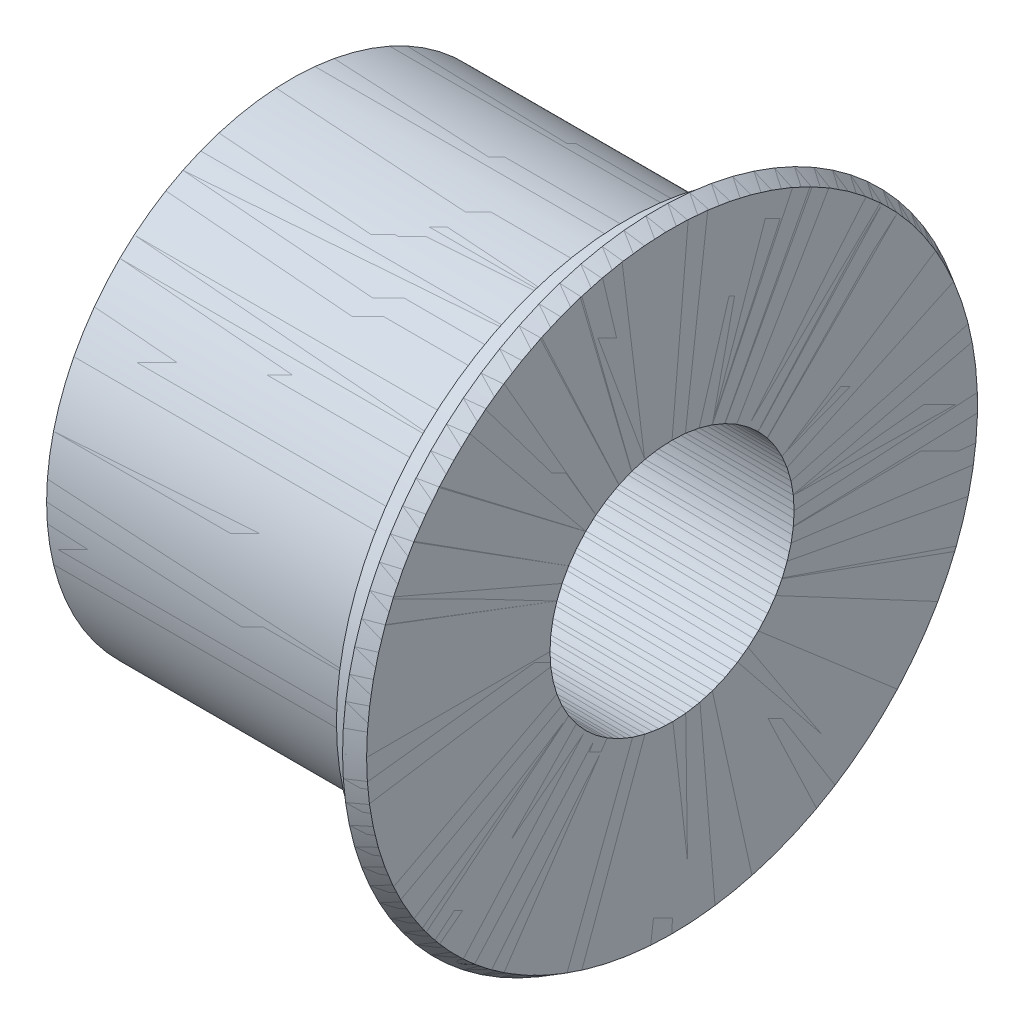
ISO-10303-21;
HEADER;
FILE_DESCRIPTION(('STEP AP214'),'2;1');
FILE_NAME('part.step','',(''),(''),'','','');
FILE_SCHEMA(('AUTOMOTIVE_DESIGN { 1 0 10303 214 1 1 1 1 }'));
ENDSEC;
DATA;
#1=APPLICATION_CONTEXT('core data for automotive mechanical design processes');
#2=APPLICATION_PROTOCOL_DEFINITION('international standard','automotive_design',2000,#1);
#3=PRODUCT_CONTEXT('',#1,'mechanical');
#4=PRODUCT('Part','Part','',(#3));
#5=PRODUCT_RELATED_PRODUCT_CATEGORY('part','',(#4));
#6=PRODUCT_DEFINITION_FORMATION('','',#4);
#7=PRODUCT_DEFINITION_CONTEXT('part definition',#1,'design');
#8=PRODUCT_DEFINITION('design','',#6,#7);
#9=PRODUCT_DEFINITION_SHAPE('','',#8);
#10=(LENGTH_UNIT() NAMED_UNIT(*) SI_UNIT(.MILLI.,.METRE.));
#11=(NAMED_UNIT(*) PLANE_ANGLE_UNIT() SI_UNIT($,.RADIAN.));
#12=(NAMED_UNIT(*) SI_UNIT($,.STERADIAN.) SOLID_ANGLE_UNIT());
#13=UNCERTAINTY_MEASURE_WITH_UNIT(LENGTH_MEASURE(1.E-05),#10,'distance_accuracy_value','');
#14=(GEOMETRIC_REPRESENTATION_CONTEXT(3) GLOBAL_UNCERTAINTY_ASSIGNED_CONTEXT((#13)) GLOBAL_UNIT_ASSIGNED_CONTEXT((#10,
#11,#12)) REPRESENTATION_CONTEXT('',''));
#15=CARTESIAN_POINT('',(0.,0.,0.));
#16=DIRECTION('',(0.,0.,1.));
#17=DIRECTION('',(1.,0.,0.));
#18=AXIS2_PLACEMENT_3D('',#15,#16,#17);
#19=CARTESIAN_POINT('',(25.,0.,0.));
#20=DIRECTION('',(-1.,0.,0.));
#21=DIRECTION('',(0.,0.,1.));
#22=AXIS2_PLACEMENT_3D('',#19,#20,#21);
#23=CONICAL_SURFACE('',#22,20.0226497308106,0.52359877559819);
#24=CARTESIAN_POINT('',(24.,0.,0.));
#25=DIRECTION('',(-1.,0.,0.));
#26=DIRECTION('',(0.,0.,1.));
#27=AXIS2_PLACEMENT_3D('',#24,#25,#26);
#28=CIRCLE('',#27,20.6000000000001);
#29=CARTESIAN_POINT('',(24.,0.,20.6000000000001));
#30=VERTEX_POINT('',#29);
#31=EDGE_CURVE('P0_E93',#30,#30,#28,.T.);
#32=ORIENTED_EDGE('',*,*,#31,.F.);
#33=EDGE_LOOP('',(#32));
#34=FACE_BOUND('',#33,.T.);
#35=CARTESIAN_POINT('',(25.0502,-14.5941538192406,13.6659205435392));
#36=CARTESIAN_POINT('',(25.0134050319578,-14.6074747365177,13.6827670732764));
#37=CARTESIAN_POINT('',(24.9763212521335,-14.6237358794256,13.696731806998));
#38=CARTESIAN_POINT('',(24.9028215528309,-14.6615461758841,13.7184393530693));
#39=CARTESIAN_POINT('',(24.8664092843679,-14.6831182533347,13.7261545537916));
#40=CARTESIAN_POINT('',(24.800336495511,-14.727793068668,13.7342007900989));
#41=CARTESIAN_POINT('',(24.7704064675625,-14.750351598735,13.735346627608));
#42=CARTESIAN_POINT('',(24.7133785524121,-14.7983592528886,13.7320608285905));
#43=CARTESIAN_POINT('',(24.686272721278,-14.8237998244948,13.7276453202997));
#44=CARTESIAN_POINT('',(24.6417129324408,-14.8708810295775,13.7145970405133));
#45=CARTESIAN_POINT('',(24.623458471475,-14.8920919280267,13.7071340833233));
#46=CARTESIAN_POINT('',(24.5899994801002,-14.9353518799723,13.6885915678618));
#47=CARTESIAN_POINT('',(24.5747944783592,-14.9574008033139,13.6775125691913));
#48=CARTESIAN_POINT('',(24.5480502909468,-15.0018440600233,13.6517038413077));
#49=CARTESIAN_POINT('',(24.5365343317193,-15.0242396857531,13.6369519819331));
#50=CARTESIAN_POINT('',(24.517969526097,-15.0684290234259,13.6041078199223));
#51=CARTESIAN_POINT('',(24.5109171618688,-15.0902231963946,13.5860181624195));
#52=CARTESIAN_POINT('',(24.502273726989,-15.129881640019,13.5493141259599));
#53=CARTESIAN_POINT('',(24.5001464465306,-15.1479092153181,13.5310010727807));
#54=CARTESIAN_POINT('',(24.4998683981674,-15.1821929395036,13.4927639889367));
#55=CARTESIAN_POINT('',(24.5017161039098,-15.1984497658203,13.472840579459));
#56=CARTESIAN_POINT('',(24.5090547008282,-15.2278073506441,13.4332435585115));
#57=CARTESIAN_POINT('',(24.5143253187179,-15.2410373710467,13.4136239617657));
#58=CARTESIAN_POINT('',(24.528036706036,-15.2652132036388,13.3740946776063));
#59=CARTESIAN_POINT('',(24.5364777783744,-15.2761587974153,13.3541849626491));
#60=CARTESIAN_POINT('',(24.5565877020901,-15.296023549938,13.3137509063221));
#61=CARTESIAN_POINT('',(24.5683768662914,-15.3048387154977,13.2932357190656));
#62=CARTESIAN_POINT('',(24.5945571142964,-15.3197916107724,13.2529089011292));
#63=CARTESIAN_POINT('',(24.6089491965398,-15.3259283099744,13.233097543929));
#64=CARTESIAN_POINT('',(24.6416414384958,-15.3361231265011,13.1923590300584));
#65=CARTESIAN_POINT('',(24.6601998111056,-15.3398660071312,13.171560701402));
#66=CARTESIAN_POINT('',(24.699402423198,-15.3442412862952,13.1316800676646));
#67=CARTESIAN_POINT('',(24.7200476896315,-15.3448721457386,13.1125986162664));
#68=CARTESIAN_POINT('',(24.7659280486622,-15.3430819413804,13.0738904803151));
#69=CARTESIAN_POINT('',(24.791400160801,-15.340218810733,13.0545650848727));
#70=CARTESIAN_POINT('',(24.8437202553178,-15.33094161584,13.0188401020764));
#71=CARTESIAN_POINT('',(24.8705690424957,-15.3245254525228,13.0024422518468));
#72=CARTESIAN_POINT('',(24.9228758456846,-15.3090347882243,12.9740161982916));
#73=CARTESIAN_POINT('',(24.9482768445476,-15.3002094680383,12.9617455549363));
#74=CARTESIAN_POINT('',(24.9992265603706,-15.2799665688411,12.9401312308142));
#75=CARTESIAN_POINT('',(25.0247749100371,-15.2685538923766,12.9307820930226));
#76=CARTESIAN_POINT('',(25.0502,-15.2559318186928,12.9229738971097));
#77=B_SPLINE_CURVE_WITH_KNOTS('',3,(#35,#36,#37,#38,#39,#40,#41,#42,#43,#44,#45,#46,#47,#48,#49,
#50,#51,#52,#53,#54,#55,#56,#57,#58,#59,#60,#61,#62,#63,#64,#65,#66,#67,#68,#69,#70,#71,#72,#73,
#74,#75,#76),.UNSPECIFIED.,.F.,.F.,(4,2,2,2,2,2,2,2,2,2,2,2,2,2,2,2,2,2,2,2,4),(0.,
0.127678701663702,0.255918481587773,0.367837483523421,0.479432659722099,0.565965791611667,
0.652485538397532,0.739539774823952,0.826525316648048,0.903475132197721,0.980395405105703,
1.05279942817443,1.12521037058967,1.20065211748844,1.27612286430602,1.36016526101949,
1.44424921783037,1.54016827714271,1.63614406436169,1.72456054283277,1.8128108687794),.UNSPECIFIED.);
#78=CARTESIAN_POINT('',(25.,-14.6140752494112,13.6870488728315));
#79=VERTEX_POINT('',#78);
#80=CARTESIAN_POINT('',(25.,-15.2792140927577,12.9403291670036));
#81=VERTEX_POINT('',#80);
#82=EDGE_CURVE('P0_E51',#79,#81,#77,.T.);
#83=ORIENTED_EDGE('',*,*,#82,.F.);
#84=CARTESIAN_POINT('',(25.,0.,0.));
#85=DIRECTION('',(-1.,0.,0.));
#86=DIRECTION('',(0.,0.,1.));
#87=AXIS2_PLACEMENT_3D('',#84,#85,#86);
#88=CIRCLE('',#87,20.0226497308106);
#89=EDGE_CURVE('P0_E34',#81,#79,#88,.F.);
#90=ORIENTED_EDGE('',*,*,#89,.F.);
#91=EDGE_LOOP('',(#83,#90));
#92=FACE_BOUND('',#91,.T.);
#93=ADVANCED_FACE('P0_F30',(#34,#92),#23,.T.);
#94=CARTESIAN_POINT('',(25.,-4.42964568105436,-27.967682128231));
#95=DIRECTION('',(1.,0.,0.));
#96=DIRECTION('',(0.,0.809016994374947,0.587785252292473));
#97=AXIS2_PLACEMENT_3D('',#94,#95,#96);
#98=PLANE('',#97);
#99=CARTESIAN_POINT('',(25.,0.,0.));
#100=DIRECTION('',(-1.,0.,0.));
#101=DIRECTION('',(0.,0.,1.));
#102=AXIS2_PLACEMENT_3D('',#99,#100,#101);
#103=CIRCLE('',#102,8.00000000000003);
#104=CARTESIAN_POINT('',(25.,-6.29464815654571,4.93734793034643));
#105=VERTEX_POINT('',#104);
#106=CARTESIAN_POINT('',(25.,-5.6295093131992,5.68406763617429));
#107=VERTEX_POINT('',#106);
#108=EDGE_CURVE('P0_E40',#105,#107,#103,.F.);
#109=ORIENTED_EDGE('',*,*,#108,.F.);
#110=DIRECTION('',(0.,0.746719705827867,-0.665138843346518));
#111=VECTOR('',#110,1.);
#112=CARTESIAN_POINT('',(25.,-0.332569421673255,-0.373359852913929));
#113=LINE('',#112,#111);
#114=EDGE_CURVE('P0_E47',#105,#81,#113,.F.);
#115=ORIENTED_EDGE('',*,*,#114,.T.);
#116=ORIENTED_EDGE('',*,*,#89,.T.);
#117=DIRECTION('',(0.,0.746719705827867,-0.665138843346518));
#118=VECTOR('',#117,1.);
#119=CARTESIAN_POINT('',(25.,0.332569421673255,0.373359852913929));
#120=LINE('',#119,#118);
#121=EDGE_CURVE('P0_E57',#79,#107,#120,.T.);
#122=ORIENTED_EDGE('',*,*,#121,.T.);
#123=EDGE_LOOP('',(#109,#115,#116,#122));
#124=FACE_BOUND('',#123,.T.);
#125=ADVANCED_FACE('P0_F32',(#124),#98,.T.);
#126=CARTESIAN_POINT('',(25.,0.,0.));
#127=DIRECTION('',(-1.,0.,0.));
#128=DIRECTION('',(0.,0.,1.));
#129=AXIS2_PLACEMENT_3D('',#126,#127,#128);
#130=CYLINDRICAL_SURFACE('',#129,8.00000000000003);
#131=CARTESIAN_POINT('',(0.,0.,0.));
#132=DIRECTION('',(-1.,0.,0.));
#133=DIRECTION('',(0.,0.,1.));
#134=AXIS2_PLACEMENT_3D('',#131,#132,#133);
#135=CIRCLE('',#134,8.00000000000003);
#136=CARTESIAN_POINT('',(0.,0.,8.00000000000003));
#137=VERTEX_POINT('',#136);
#138=EDGE_CURVE('P0_E66',#137,#137,#135,.T.);
#139=ORIENTED_EDGE('',*,*,#138,.T.);
#140=EDGE_LOOP('',(#139));
#141=FACE_BOUND('',#140,.T.);
#142=ORIENTED_EDGE('',*,*,#108,.T.);
#143=CARTESIAN_POINT('',(25.,-5.6295093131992,5.68406763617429));
#144=CARTESIAN_POINT('',(24.9719005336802,-5.62948906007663,5.68408175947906));
#145=CARTESIAN_POINT('',(24.9438088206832,-5.63119453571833,5.68239849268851));
#146=CARTESIAN_POINT('',(24.8884432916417,-5.63790705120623,5.67574173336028));
#147=CARTESIAN_POINT('',(24.8611688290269,-5.64291140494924,5.67077091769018));
#148=CARTESIAN_POINT('',(24.8081805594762,-5.65607506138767,5.65764048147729));
#149=CARTESIAN_POINT('',(24.7824674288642,-5.66423572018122,5.64947949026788));
#150=CARTESIAN_POINT('',(24.7333440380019,-5.68342948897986,5.63017007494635));
#151=CARTESIAN_POINT('',(24.7099333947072,-5.69446212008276,5.6190221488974));
#152=CARTESIAN_POINT('',(24.6660426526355,-5.71905349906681,5.59399088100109));
#153=CARTESIAN_POINT('',(24.6455662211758,-5.73261536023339,5.58010416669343));
#154=CARTESIAN_POINT('',(24.6081538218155,-5.76181867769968,5.54994462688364));
#155=CARTESIAN_POINT('',(24.5912183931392,-5.7774604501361,5.53367143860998));
#156=CARTESIAN_POINT('',(24.5613601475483,-5.81033940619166,5.49913847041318));
#157=CARTESIAN_POINT('',(24.548440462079,-5.82757782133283,5.48087715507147));
#158=CARTESIAN_POINT('',(24.5270012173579,-5.86310405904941,5.44285650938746));
#159=CARTESIAN_POINT('',(24.518481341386,-5.88139180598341,5.42309728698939));
#160=CARTESIAN_POINT('',(24.5060930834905,-5.91844113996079,5.38263926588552));
#161=CARTESIAN_POINT('',(24.5022186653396,-5.93720207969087,5.3619417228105));
#162=CARTESIAN_POINT('',(24.4992126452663,-5.97467196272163,5.32015810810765));
#163=CARTESIAN_POINT('',(24.5000811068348,-5.99338090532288,5.29907203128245));
#164=CARTESIAN_POINT('',(24.5065313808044,-6.03019114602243,5.25714486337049));
#165=CARTESIAN_POINT('',(24.5121065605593,-6.04829326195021,5.23630346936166));
#166=CARTESIAN_POINT('',(24.5278016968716,-6.08342607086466,5.1954454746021));
#167=CARTESIAN_POINT('',(24.537921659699,-6.10045676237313,5.17542887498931));
#168=CARTESIAN_POINT('',(24.5624268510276,-6.13301485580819,5.13680522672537));
#169=CARTESIAN_POINT('',(24.5768151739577,-6.14854115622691,5.11819921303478));
#170=CARTESIAN_POINT('',(24.6094456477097,-6.17768709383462,5.08298195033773));
#171=CARTESIAN_POINT('',(24.6276876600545,-6.19130679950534,5.06637062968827));
#172=CARTESIAN_POINT('',(24.6675424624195,-6.21633166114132,5.03563450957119));
#173=CARTESIAN_POINT('',(24.6891605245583,-6.22773328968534,5.02151367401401));
#174=CARTESIAN_POINT('',(24.7351435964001,-6.24803065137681,4.99623627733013));
#175=CARTESIAN_POINT('',(24.7595094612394,-6.2569256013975,4.98508064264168));
#176=CARTESIAN_POINT('',(24.8103071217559,-6.27200630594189,4.96609342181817));
#177=CARTESIAN_POINT('',(24.8367402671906,-6.2781902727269,4.95826402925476));
#178=CARTESIAN_POINT('',(24.8908754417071,-6.28769073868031,4.94621144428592));
#179=CARTESIAN_POINT('',(24.9185754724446,-6.29101160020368,4.9419827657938));
#180=CARTESIAN_POINT('',(24.9642820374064,-6.29405786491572,4.93810003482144));
#181=CARTESIAN_POINT('',(24.9821455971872,-6.29465215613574,4.93734092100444));
#182=CARTESIAN_POINT('',(25.,-6.29464815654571,4.93734793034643));
#183=B_SPLINE_CURVE_WITH_KNOTS('',3,(#143,#144,#145,#146,#147,#148,#149,#150,#151,#152,#153,
#154,#155,#156,#157,#158,#159,#160,#161,#162,#163,#164,#165,#166,#167,#168,#169,#170,#171,#172,
#173,#174,#175,#176,#177,#178,#179,#180,#181,#182),.UNSPECIFIED.,.F.,.F.,(4,2,2,2,2,2,2,2,2,2,2,
2,2,2,2,2,2,2,2,4),(0.,0.084185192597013,0.168301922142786,0.252454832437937,0.336593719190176,
0.420836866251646,0.505092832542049,0.589414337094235,0.673729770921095,0.757935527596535,
0.842142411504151,0.926230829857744,1.01031936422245,1.09446900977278,1.17861563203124,
1.26289499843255,1.34720066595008,1.43156184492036,1.51579425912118,1.56935591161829),.UNSPECIFIED.);
#184=EDGE_CURVE('P0_E11',#107,#105,#183,.T.);
#185=ORIENTED_EDGE('',*,*,#184,.T.);
#186=EDGE_LOOP('',(#142,#185));
#187=FACE_BOUND('',#186,.T.);
#188=ADVANCED_FACE('P0_F65',(#141,#187),#130,.F.);
#189=CARTESIAN_POINT('',(23.,-4.20340309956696,-26.539242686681));
#190=DIRECTION('',(1.,0.,0.));
#191=DIRECTION('',(0.,0.809016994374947,0.587785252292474));
#192=AXIS2_PLACEMENT_3D('',#189,#190,#191);
#193=PLANE('',#192);
#194=CARTESIAN_POINT('',(23.,0.,0.));
#195=DIRECTION('',(-1.,0.,0.));
#196=DIRECTION('',(0.,0.,1.));
#197=AXIS2_PLACEMENT_3D('',#194,#195,#196);
#198=CIRCLE('',#197,16.9999999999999);
#199=CARTESIAN_POINT('',(23.,0.,16.9999999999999));
#200=VERTEX_POINT('',#199);
#201=EDGE_CURVE('P0_E113',#200,#200,#198,.T.);
#202=ORIENTED_EDGE('',*,*,#201,.T.);
#203=EDGE_LOOP('',(#202));
#204=FACE_BOUND('',#203,.T.);
#205=CARTESIAN_POINT('',(23.,0.,0.));
#206=DIRECTION('',(-1.,0.,0.));
#207=DIRECTION('',(0.,0.,1.));
#208=AXIS2_PLACEMENT_3D('',#205,#206,#207);
#209=CIRCLE('',#208,19.);
#210=CARTESIAN_POINT('',(23.,0.,19.));
#211=VERTEX_POINT('',#210);
#212=EDGE_CURVE('P0_E118',#211,#211,#209,.F.);
#213=ORIENTED_EDGE('',*,*,#212,.T.);
#214=EDGE_LOOP('',(#213));
#215=FACE_BOUND('',#214,.T.);
#216=ADVANCED_FACE('P0_F138',(#204,#215),#193,.T.);
#217=CARTESIAN_POINT('',(23.,0.,0.));
#218=DIRECTION('',(-1.,0.,0.));
#219=DIRECTION('',(0.,0.,1.));
#220=AXIS2_PLACEMENT_3D('',#217,#218,#219);
#221=CYLINDRICAL_SURFACE('',#220,19.);
#222=ORIENTED_EDGE('',*,*,#212,.F.);
#223=EDGE_LOOP('',(#222));
#224=FACE_BOUND('',#223,.T.);
#225=CARTESIAN_POINT('',(22.,0.,0.));
#226=DIRECTION('',(-1.,0.,0.));
#227=DIRECTION('',(0.,0.,1.));
#228=AXIS2_PLACEMENT_3D('',#225,#226,#227);
#229=CIRCLE('',#228,19.);
#230=CARTESIAN_POINT('',(22.,0.,19.));
#231=VERTEX_POINT('',#230);
#232=EDGE_CURVE('P0_E108',#231,#231,#229,.T.);
#233=ORIENTED_EDGE('',*,*,#232,.F.);
#234=EDGE_LOOP('',(#233));
#235=FACE_BOUND('',#234,.T.);
#236=ADVANCED_FACE('P0_F143',(#224,#235),#221,.T.);
#237=CARTESIAN_POINT('',(24.,0.,0.));
#238=DIRECTION('',(-1.,0.,0.));
#239=DIRECTION('',(0.,0.,1.));
#240=AXIS2_PLACEMENT_3D('',#237,#238,#239);
#241=CYLINDRICAL_SURFACE('',#240,16.9999999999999);
#242=CARTESIAN_POINT('',(24.,0.,0.));
#243=DIRECTION('',(-1.,0.,0.));
#244=DIRECTION('',(0.,0.,1.));
#245=AXIS2_PLACEMENT_3D('',#242,#243,#244);
#246=CIRCLE('',#245,16.9999999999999);
#247=CARTESIAN_POINT('',(24.,0.,16.9999999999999));
#248=VERTEX_POINT('',#247);
#249=EDGE_CURVE('P0_E103',#248,#248,#246,.F.);
#250=ORIENTED_EDGE('',*,*,#249,.F.);
#251=EDGE_LOOP('',(#250));
#252=FACE_BOUND('',#251,.T.);
#253=ORIENTED_EDGE('',*,*,#201,.F.);
#254=EDGE_LOOP('',(#253));
#255=FACE_BOUND('',#254,.T.);
#256=ADVANCED_FACE('P0_F149',(#252,#255),#241,.T.);
#257=CARTESIAN_POINT('',(22.,-26.539242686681,4.20340309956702));
#258=DIRECTION('',(-1.,0.,0.));
#259=DIRECTION('',(0.,0.809016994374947,0.587785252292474));
#260=AXIS2_PLACEMENT_3D('',#257,#258,#259);
#261=PLANE('',#260);
#262=CARTESIAN_POINT('',(22.,0.,0.));
#263=DIRECTION('',(-1.,0.,0.));
#264=DIRECTION('',(0.,0.,1.));
#265=AXIS2_PLACEMENT_3D('',#262,#263,#264);
#266=CIRCLE('',#265,15.9999999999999);
#267=CARTESIAN_POINT('',(22.,0.,15.9999999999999));
#268=VERTEX_POINT('',#267);
#269=EDGE_CURVE('P0_E98',#268,#268,#266,.F.);
#270=ORIENTED_EDGE('',*,*,#269,.T.);
#271=EDGE_LOOP('',(#270));
#272=FACE_BOUND('',#271,.T.);
#273=ORIENTED_EDGE('',*,*,#232,.T.);
#274=EDGE_LOOP('',(#273));
#275=FACE_BOUND('',#274,.T.);
#276=ADVANCED_FACE('P0_F145',(#272,#275),#261,.T.);
#277=CARTESIAN_POINT('',(24.,-28.774126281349,4.557373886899));
#278=DIRECTION('',(-1.,0.,0.));
#279=DIRECTION('',(0.,0.809016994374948,0.587785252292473));
#280=AXIS2_PLACEMENT_3D('',#277,#278,#279);
#281=PLANE('',#280);
#282=ORIENTED_EDGE('',*,*,#249,.T.);
#283=EDGE_LOOP('',(#282));
#284=FACE_BOUND('',#283,.T.);
#285=ORIENTED_EDGE('',*,*,#31,.T.);
#286=EDGE_LOOP('',(#285));
#287=FACE_BOUND('',#286,.T.);
#288=ADVANCED_FACE('P0_F148',(#284,#287),#281,.T.);
#289=CARTESIAN_POINT('',(22.,0.,0.));
#290=DIRECTION('',(-1.,0.,0.));
#291=DIRECTION('',(0.,0.,1.));
#292=AXIS2_PLACEMENT_3D('',#289,#290,#291);
#293=CYLINDRICAL_SURFACE('',#292,15.9999999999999);
#294=ORIENTED_EDGE('',*,*,#269,.F.);
#295=EDGE_LOOP('',(#294));
#296=FACE_BOUND('',#295,.T.);
#297=CARTESIAN_POINT('',(0.,0.,0.));
#298=DIRECTION('',(-1.,0.,0.));
#299=DIRECTION('',(0.,0.,1.));
#300=AXIS2_PLACEMENT_3D('',#297,#298,#299);
#301=CIRCLE('',#300,15.9999999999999);
#302=CARTESIAN_POINT('',(0.,0.,15.9999999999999));
#303=VERTEX_POINT('',#302);
#304=EDGE_CURVE('P0_E90',#303,#303,#301,.T.);
#305=ORIENTED_EDGE('',*,*,#304,.F.);
#306=EDGE_LOOP('',(#305));
#307=FACE_BOUND('',#306,.T.);
#308=ADVANCED_FACE('P0_F133',(#296,#307),#293,.T.);
#309=CARTESIAN_POINT('',(0.,-22.348835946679,3.53970787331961));
#310=DIRECTION('',(-1.,0.,0.));
#311=DIRECTION('',(0.,0.809016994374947,0.587785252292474));
#312=AXIS2_PLACEMENT_3D('',#309,#310,#311);
#313=PLANE('',#312);
#314=ORIENTED_EDGE('',*,*,#138,.F.);
#315=EDGE_LOOP('',(#314));
#316=FACE_BOUND('',#315,.T.);
#317=ORIENTED_EDGE('',*,*,#304,.T.);
#318=EDGE_LOOP('',(#317));
#319=FACE_BOUND('',#318,.T.);
#320=ADVANCED_FACE('P0_F140',(#316,#319),#313,.T.);
#321=CARTESIAN_POINT('',(25.,0.,0.));
#322=DIRECTION('',(0.,0.746719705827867,-0.665138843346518));
#323=DIRECTION('',(0.,0.665138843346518,0.746719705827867));
#324=AXIS2_PLACEMENT_3D('',#321,#322,#323);
#325=CYLINDRICAL_SURFACE('',#324,0.499999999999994);
#326=ORIENTED_EDGE('',*,*,#82,.T.);
#327=ORIENTED_EDGE('',*,*,#114,.F.);
#328=ORIENTED_EDGE('',*,*,#184,.F.);
#329=ORIENTED_EDGE('',*,*,#121,.F.);
#330=EDGE_LOOP('',(#326,#327,#328,#329));
#331=FACE_BOUND('',#330,.T.);
#332=ADVANCED_FACE('P0_F56',(#331),#325,.F.);
#333=CLOSED_SHELL('',(#93,#125,#188,#216,#236,#256,#276,#288,#308,#320,#332));
#334=MANIFOLD_SOLID_BREP('P0_B2',#333);
#335=CARTESIAN_POINT('',(23.,-4.20340309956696,-26.539242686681));
#336=DIRECTION('',(1.,0.,0.));
#337=DIRECTION('',(0.,0.809016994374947,0.587785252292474));
#338=AXIS2_PLACEMENT_3D('',#335,#336,#337);
#339=PLANE('',#338);
#340=CARTESIAN_POINT('',(23.,0.,0.));
#341=DIRECTION('',(-1.,0.,0.));
#342=DIRECTION('',(0.,0.,1.));
#343=AXIS2_PLACEMENT_3D('',#340,#341,#342);
#344=CIRCLE('',#343,16.9999999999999);
#345=CARTESIAN_POINT('',(23.,0.,16.9999999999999));
#346=VERTEX_POINT('',#345);
#347=EDGE_CURVE('P1_E62',#346,#346,#344,.T.);
#348=ORIENTED_EDGE('',*,*,#347,.T.);
#349=EDGE_LOOP('',(#348));
#350=FACE_BOUND('',#349,.T.);
#351=CARTESIAN_POINT('',(23.,0.,0.));
#352=DIRECTION('',(-1.,0.,0.));
#353=DIRECTION('',(0.,0.,1.));
#354=AXIS2_PLACEMENT_3D('',#351,#352,#353);
#355=CIRCLE('',#354,19.);
#356=CARTESIAN_POINT('',(23.,0.,19.));
#357=VERTEX_POINT('',#356);
#358=EDGE_CURVE('P1_E67',#357,#357,#355,.F.);
#359=ORIENTED_EDGE('',*,*,#358,.T.);
#360=EDGE_LOOP('',(#359));
#361=FACE_BOUND('',#360,.T.);
#362=ADVANCED_FACE('P1_F14',(#350,#361),#339,.T.);
#363=CARTESIAN_POINT('',(23.,0.,0.));
#364=DIRECTION('',(-1.,0.,0.));
#365=DIRECTION('',(0.,0.,1.));
#366=AXIS2_PLACEMENT_3D('',#363,#364,#365);
#367=CYLINDRICAL_SURFACE('',#366,19.);
#368=ORIENTED_EDGE('',*,*,#358,.F.);
#369=EDGE_LOOP('',(#368));
#370=FACE_BOUND('',#369,.T.);
#371=CARTESIAN_POINT('',(22.,0.,0.));
#372=DIRECTION('',(-1.,0.,0.));
#373=DIRECTION('',(0.,0.,1.));
#374=AXIS2_PLACEMENT_3D('',#371,#372,#373);
#375=CIRCLE('',#374,19.);
#376=CARTESIAN_POINT('',(22.,0.,19.));
#377=VERTEX_POINT('',#376);
#378=EDGE_CURVE('P1_E57',#377,#377,#375,.T.);
#379=ORIENTED_EDGE('',*,*,#378,.F.);
#380=EDGE_LOOP('',(#379));
#381=FACE_BOUND('',#380,.T.);
#382=ADVANCED_FACE('P1_F73',(#370,#381),#367,.T.);
#383=CARTESIAN_POINT('',(24.,0.,0.));
#384=DIRECTION('',(-1.,0.,0.));
#385=DIRECTION('',(0.,0.,1.));
#386=AXIS2_PLACEMENT_3D('',#383,#384,#385);
#387=CYLINDRICAL_SURFACE('',#386,16.9999999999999);
#388=CARTESIAN_POINT('',(24.,0.,0.));
#389=DIRECTION('',(-1.,0.,0.));
#390=DIRECTION('',(0.,0.,1.));
#391=AXIS2_PLACEMENT_3D('',#388,#389,#390);
#392=CIRCLE('',#391,16.9999999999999);
#393=CARTESIAN_POINT('',(24.,0.,16.9999999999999));
#394=VERTEX_POINT('',#393);
#395=EDGE_CURVE('P1_E52',#394,#394,#392,.F.);
#396=ORIENTED_EDGE('',*,*,#395,.F.);
#397=EDGE_LOOP('',(#396));
#398=FACE_BOUND('',#397,.T.);
#399=ORIENTED_EDGE('',*,*,#347,.F.);
#400=EDGE_LOOP('',(#399));
#401=FACE_BOUND('',#400,.T.);
#402=ADVANCED_FACE('P1_F76',(#398,#401),#387,.T.);
#403=CARTESIAN_POINT('',(22.,-26.539242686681,4.20340309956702));
#404=DIRECTION('',(-1.,0.,0.));
#405=DIRECTION('',(0.,0.809016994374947,0.587785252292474));
#406=AXIS2_PLACEMENT_3D('',#403,#404,#405);
#407=PLANE('',#406);
#408=CARTESIAN_POINT('',(22.,0.,0.));
#409=DIRECTION('',(-1.,0.,0.));
#410=DIRECTION('',(0.,0.,1.));
#411=AXIS2_PLACEMENT_3D('',#408,#409,#410);
#412=CIRCLE('',#411,15.9999999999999);
#413=CARTESIAN_POINT('',(22.,0.,15.9999999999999));
#414=VERTEX_POINT('',#413);
#415=EDGE_CURVE('P1_E46',#414,#414,#412,.F.);
#416=ORIENTED_EDGE('',*,*,#415,.T.);
#417=EDGE_LOOP('',(#416));
#418=FACE_BOUND('',#417,.T.);
#419=ORIENTED_EDGE('',*,*,#378,.T.);
#420=EDGE_LOOP('',(#419));
#421=FACE_BOUND('',#420,.T.);
#422=ADVANCED_FACE('P1_F80',(#418,#421),#407,.T.);
#423=CARTESIAN_POINT('',(24.,-28.774126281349,4.557373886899));
#424=DIRECTION('',(-1.,0.,0.));
#425=DIRECTION('',(0.,0.809016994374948,0.587785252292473));
#426=AXIS2_PLACEMENT_3D('',#423,#424,#425);
#427=PLANE('',#426);
#428=ORIENTED_EDGE('',*,*,#395,.T.);
#429=EDGE_LOOP('',(#428));
#430=FACE_BOUND('',#429,.T.);
#431=CARTESIAN_POINT('',(24.,0.,0.));
#432=DIRECTION('',(-1.,0.,0.));
#433=DIRECTION('',(0.,0.,1.));
#434=AXIS2_PLACEMENT_3D('',#431,#432,#433);
#435=CIRCLE('',#434,20.6000000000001);
#436=CARTESIAN_POINT('',(24.,0.,20.6000000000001));
#437=VERTEX_POINT('',#436);
#438=EDGE_CURVE('P1_E41',#437,#437,#435,.T.);
#439=ORIENTED_EDGE('',*,*,#438,.T.);
#440=EDGE_LOOP('',(#439));
#441=FACE_BOUND('',#440,.T.);
#442=ADVANCED_FACE('P1_F82',(#430,#441),#427,.T.);
#443=CARTESIAN_POINT('',(22.,0.,0.));
#444=DIRECTION('',(-1.,0.,0.));
#445=DIRECTION('',(0.,0.,1.));
#446=AXIS2_PLACEMENT_3D('',#443,#444,#445);
#447=CYLINDRICAL_SURFACE('',#446,15.9999999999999);
#448=ORIENTED_EDGE('',*,*,#415,.F.);
#449=EDGE_LOOP('',(#448));
#450=FACE_BOUND('',#449,.T.);
#451=CARTESIAN_POINT('',(0.,0.,0.));
#452=DIRECTION('',(-1.,0.,0.));
#453=DIRECTION('',(0.,0.,1.));
#454=AXIS2_PLACEMENT_3D('',#451,#452,#453);
#455=CIRCLE('',#454,15.9999999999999);
#456=CARTESIAN_POINT('',(0.,0.,15.9999999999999));
#457=VERTEX_POINT('',#456);
#458=EDGE_CURVE('P1_E36',#457,#457,#455,.T.);
#459=ORIENTED_EDGE('',*,*,#458,.F.);
#460=EDGE_LOOP('',(#459));
#461=FACE_BOUND('',#460,.T.);
#462=ADVANCED_FACE('P1_F90',(#450,#461),#447,.T.);
#463=CARTESIAN_POINT('',(25.,0.,0.));
#464=DIRECTION('',(-1.,0.,0.));
#465=DIRECTION('',(0.,0.,1.));
#466=AXIS2_PLACEMENT_3D('',#463,#464,#465);
#467=CONICAL_SURFACE('',#466,20.0226497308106,0.52359877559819);
#468=CARTESIAN_POINT('',(25.,0.,0.));
#469=DIRECTION('',(-1.,0.,0.));
#470=DIRECTION('',(0.,0.,1.));
#471=AXIS2_PLACEMENT_3D('',#468,#469,#470);
#472=CIRCLE('',#471,20.0226497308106);
#473=CARTESIAN_POINT('',(25.,0.,20.0226497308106));
#474=VERTEX_POINT('',#473);
#475=EDGE_CURVE('P1_E27',#474,#474,#472,.F.);
#476=ORIENTED_EDGE('',*,*,#475,.F.);
#477=EDGE_LOOP('',(#476));
#478=FACE_BOUND('',#477,.T.);
#479=ORIENTED_EDGE('',*,*,#438,.F.);
#480=EDGE_LOOP('',(#479));
#481=FACE_BOUND('',#480,.T.);
#482=ADVANCED_FACE('P1_F106',(#478,#481),#467,.T.);
#483=CARTESIAN_POINT('',(0.,-22.348835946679,3.53970787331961));
#484=DIRECTION('',(-1.,0.,0.));
#485=DIRECTION('',(0.,0.809016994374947,0.587785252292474));
#486=AXIS2_PLACEMENT_3D('',#483,#484,#485);
#487=PLANE('',#486);
#488=CARTESIAN_POINT('',(0.,0.,0.));
#489=DIRECTION('',(-1.,0.,0.));
#490=DIRECTION('',(0.,0.,1.));
#491=AXIS2_PLACEMENT_3D('',#488,#489,#490);
#492=CIRCLE('',#491,8.00000000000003);
#493=CARTESIAN_POINT('',(0.,0.,8.00000000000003));
#494=VERTEX_POINT('',#493);
#495=EDGE_CURVE('P1_E22',#494,#494,#492,.T.);
#496=ORIENTED_EDGE('',*,*,#495,.F.);
#497=EDGE_LOOP('',(#496));
#498=FACE_BOUND('',#497,.T.);
#499=ORIENTED_EDGE('',*,*,#458,.T.);
#500=EDGE_LOOP('',(#499));
#501=FACE_BOUND('',#500,.T.);
#502=ADVANCED_FACE('P1_F103',(#498,#501),#487,.T.);
#503=CARTESIAN_POINT('',(25.,-4.42964568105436,-27.967682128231));
#504=DIRECTION('',(1.,0.,0.));
#505=DIRECTION('',(0.,0.809016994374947,0.587785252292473));
#506=AXIS2_PLACEMENT_3D('',#503,#504,#505);
#507=PLANE('',#506);
#508=CARTESIAN_POINT('',(25.,0.,0.));
#509=DIRECTION('',(-1.,0.,0.));
#510=DIRECTION('',(0.,0.,1.));
#511=AXIS2_PLACEMENT_3D('',#508,#509,#510);
#512=CIRCLE('',#511,8.00000000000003);
#513=CARTESIAN_POINT('',(25.,0.,8.00000000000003));
#514=VERTEX_POINT('',#513);
#515=EDGE_CURVE('P1_E10',#514,#514,#512,.F.);
#516=ORIENTED_EDGE('',*,*,#515,.F.);
#517=EDGE_LOOP('',(#516));
#518=FACE_BOUND('',#517,.T.);
#519=ORIENTED_EDGE('',*,*,#475,.T.);
#520=EDGE_LOOP('',(#519));
#521=FACE_BOUND('',#520,.T.);
#522=ADVANCED_FACE('P1_F16',(#518,#521),#507,.T.);
#523=CARTESIAN_POINT('',(25.,0.,0.));
#524=DIRECTION('',(-1.,0.,0.));
#525=DIRECTION('',(0.,0.,1.));
#526=AXIS2_PLACEMENT_3D('',#523,#524,#525);
#527=CYLINDRICAL_SURFACE('',#526,8.00000000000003);
#528=ORIENTED_EDGE('',*,*,#495,.T.);
#529=EDGE_LOOP('',(#528));
#530=FACE_BOUND('',#529,.T.);
#531=ORIENTED_EDGE('',*,*,#515,.T.);
#532=EDGE_LOOP('',(#531));
#533=FACE_BOUND('',#532,.T.);
#534=ADVANCED_FACE('P1_F96',(#530,#533),#527,.F.);
#535=CLOSED_SHELL('',(#362,#382,#402,#422,#442,#462,#482,#502,#522,#534));
#536=MANIFOLD_SOLID_BREP('P1_B1',#535);
#537=ADVANCED_BREP_SHAPE_REPRESENTATION('',(#18,#334,#536),#14);
#538=SHAPE_DEFINITION_REPRESENTATION(#9,#537);
ENDSEC;
END-ISO-10303-21;
